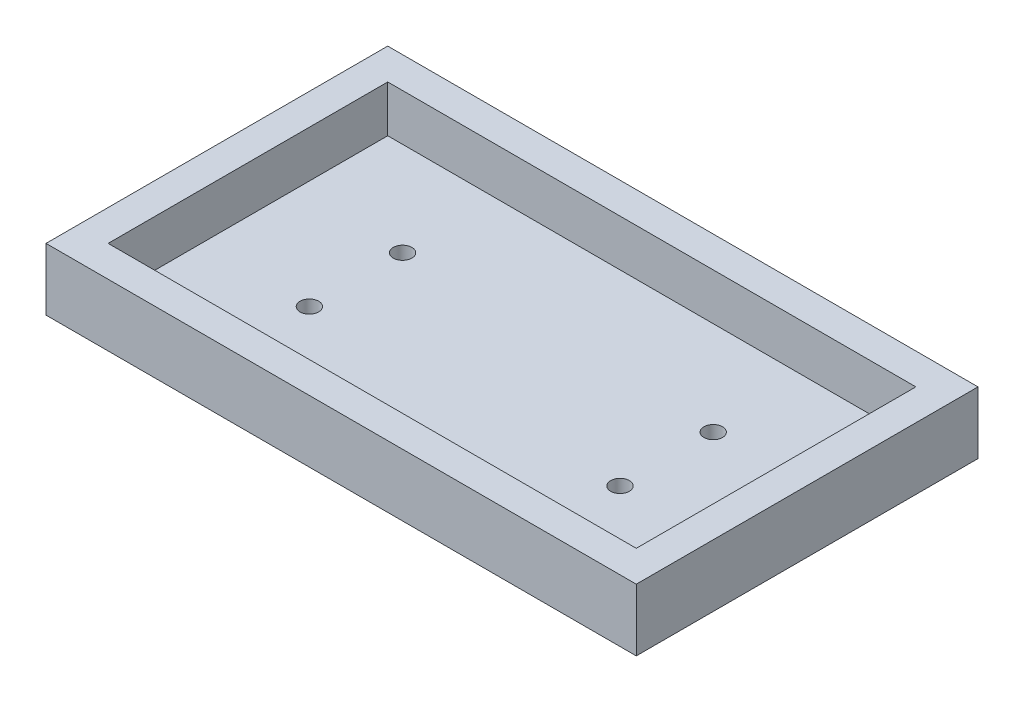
from build123d import *

# Parameters (mm, degrees)
SKETCH6_W           = 190
SKETCH6_H           = 110
SKETCH6_W_2         = 170
SKETCH6_H_2         = 90
BOSS_EXTRUDE8_DEPTH = 15
SKETCH9_W           = 190
SKETCH9_H           = 110
SKETCH9_R           = 3
BOSS_EXTRUDE9_DEPTH = 5


with BuildPart() as part:
    # Sketch6 → Boss-Extrude8 (new body)
    with BuildSketch(Plane(origin=(0, 0, 0), x_dir=(1, 0, 0), z_dir=(0, 1, 0))):
        with Locations((70.429936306, -39.984076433)):
            Rectangle(SKETCH6_W, SKETCH6_H)
        with Locations((70.429936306, -39.984076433)):
            Rectangle(SKETCH6_W_2, SKETCH6_H_2, mode=Mode.SUBTRACT)
    extrude(amount=BOSS_EXTRUDE8_DEPTH)

    # Sketch9 → Boss-Extrude9 (add)
    with BuildSketch(Plane(origin=(0, 0, 0), x_dir=(-1, 0, 0), z_dir=(0, -1, 0))):
        with Locations((-70.429936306, -39.984076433)):
            Rectangle(SKETCH9_W, SKETCH9_H)
        with Locations(Location((-20.429936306, -25.209797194, 0), (0, 0, 90))):
            Circle(SKETCH9_R, mode=Mode.SUBTRACT)
        with Locations(Location((-120.429936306, -25.209797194, 0), (0, 0, 90))):
            Circle(SKETCH9_R, mode=Mode.SUBTRACT)
        with Locations(Location((-20.429936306, -55.209797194, 0), (0, 0, 90))):
            Circle(SKETCH9_R, mode=Mode.SUBTRACT)
        with Locations(Location((-120.429936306, -55.209797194, 0), (0, 0, 90))):
            Circle(SKETCH9_R, mode=Mode.SUBTRACT)
    extrude(amount=BOSS_EXTRUDE9_DEPTH)


solid = part.part
